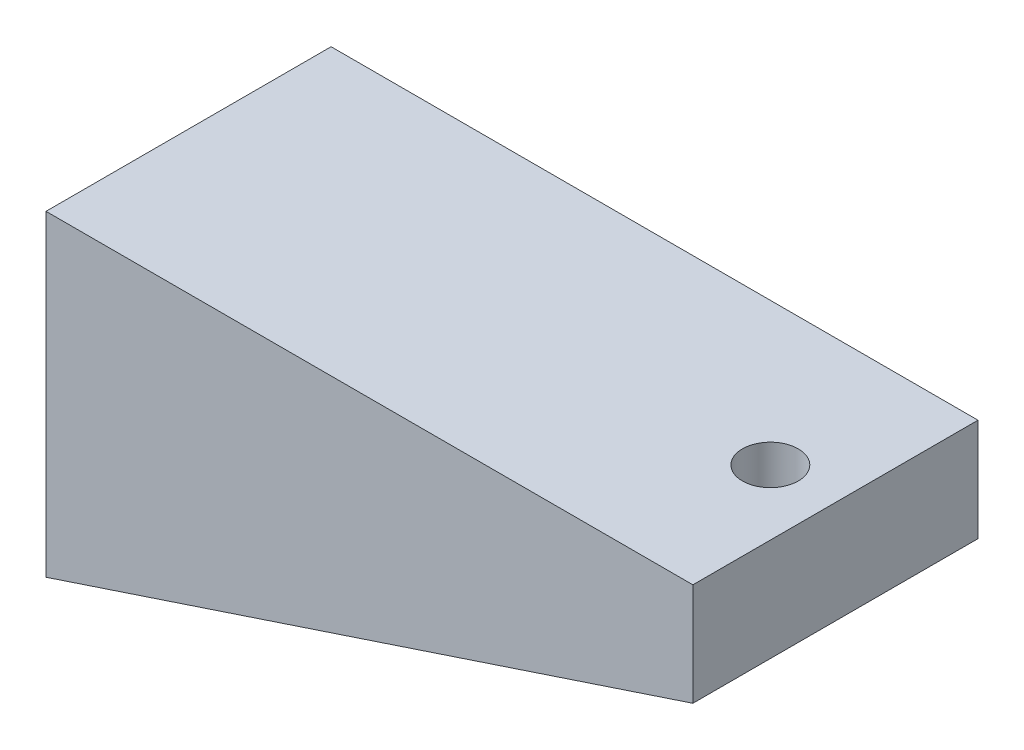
ISO-10303-21;
HEADER;
FILE_DESCRIPTION(('STEP AP214'),'2;1');
FILE_NAME('part.step','',(''),(''),'','','');
FILE_SCHEMA(('AUTOMOTIVE_DESIGN { 1 0 10303 214 1 1 1 1 }'));
ENDSEC;
DATA;
#1=APPLICATION_CONTEXT('core data for automotive mechanical design processes');
#2=APPLICATION_PROTOCOL_DEFINITION('international standard','automotive_design',2000,#1);
#3=PRODUCT_CONTEXT('',#1,'mechanical');
#4=PRODUCT('Part','Part','',(#3));
#5=PRODUCT_RELATED_PRODUCT_CATEGORY('part','',(#4));
#6=PRODUCT_DEFINITION_FORMATION('','',#4);
#7=PRODUCT_DEFINITION_CONTEXT('part definition',#1,'design');
#8=PRODUCT_DEFINITION('design','',#6,#7);
#9=PRODUCT_DEFINITION_SHAPE('','',#8);
#10=(LENGTH_UNIT() NAMED_UNIT(*) SI_UNIT(.MILLI.,.METRE.));
#11=(NAMED_UNIT(*) PLANE_ANGLE_UNIT() SI_UNIT($,.RADIAN.));
#12=(NAMED_UNIT(*) SI_UNIT($,.STERADIAN.) SOLID_ANGLE_UNIT());
#13=UNCERTAINTY_MEASURE_WITH_UNIT(LENGTH_MEASURE(1.E-05),#10,'distance_accuracy_value','');
#14=(GEOMETRIC_REPRESENTATION_CONTEXT(3) GLOBAL_UNCERTAINTY_ASSIGNED_CONTEXT((#13)) GLOBAL_UNIT_ASSIGNED_CONTEXT((#10,
#11,#12)) REPRESENTATION_CONTEXT('',''));
#15=CARTESIAN_POINT('',(0.,0.,0.));
#16=DIRECTION('',(0.,0.,1.));
#17=DIRECTION('',(1.,0.,0.));
#18=AXIS2_PLACEMENT_3D('',#15,#16,#17);
#19=CARTESIAN_POINT('',(0.,58.9096385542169,26.5));
#20=DIRECTION('',(1.,0.,0.));
#21=DIRECTION('',(0.,0.,-1.));
#22=AXIS2_PLACEMENT_3D('',#19,#20,#21);
#23=PLANE('',#22);
#24=DIRECTION('',(0.,-1.,0.));
#25=VECTOR('',#24,1.);
#26=CARTESIAN_POINT('',(0.,58.9096385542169,-26.5));
#27=LINE('',#26,#25);
#28=CARTESIAN_POINT('',(0.,58.9096385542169,-26.5));
#29=VERTEX_POINT('',#28);
#30=CARTESIAN_POINT('',(0.,0.,-26.5));
#31=VERTEX_POINT('',#30);
#32=EDGE_CURVE('E72',#29,#31,#27,.T.);
#33=ORIENTED_EDGE('',*,*,#32,.T.);
#34=DIRECTION('',(0.,0.,-1.));
#35=VECTOR('',#34,1.);
#36=CARTESIAN_POINT('',(0.,0.,26.5));
#37=LINE('',#36,#35);
#38=CARTESIAN_POINT('',(0.,0.,26.5));
#39=VERTEX_POINT('',#38);
#40=EDGE_CURVE('E12',#39,#31,#37,.T.);
#41=ORIENTED_EDGE('',*,*,#40,.F.);
#42=DIRECTION('',(0.,-1.,0.));
#43=VECTOR('',#42,1.);
#44=CARTESIAN_POINT('',(0.,58.9096385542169,26.5));
#45=LINE('',#44,#43);
#46=CARTESIAN_POINT('',(0.,58.9096385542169,26.5));
#47=VERTEX_POINT('',#46);
#48=EDGE_CURVE('E95',#47,#39,#45,.T.);
#49=ORIENTED_EDGE('',*,*,#48,.F.);
#50=DIRECTION('',(0.,0.,-1.));
#51=VECTOR('',#50,1.);
#52=CARTESIAN_POINT('',(0.,58.9096385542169,26.5));
#53=LINE('',#52,#51);
#54=EDGE_CURVE('E84',#47,#29,#53,.T.);
#55=ORIENTED_EDGE('',*,*,#54,.T.);
#56=EDGE_LOOP('',(#33,#41,#49,#55));
#57=FACE_BOUND('',#56,.T.);
#58=ADVANCED_FACE('F28',(#57),#23,.F.);
#59=CARTESIAN_POINT('',(0.,0.,26.5));
#60=DIRECTION('',(-0.314455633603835,0.949272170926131,0.));
#61=DIRECTION('',(-0.949272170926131,-0.314455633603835,0.));
#62=AXIS2_PLACEMENT_3D('',#59,#60,#61);
#63=PLANE('',#62);
#64=DIRECTION('',(0.949272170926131,0.314455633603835,0.));
#65=VECTOR('',#64,1.);
#66=CARTESIAN_POINT('',(0.,0.,-26.5));
#67=LINE('',#66,#65);
#68=CARTESIAN_POINT('',(120.25046854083,39.8341365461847,-26.5));
#69=VERTEX_POINT('',#68);
#70=EDGE_CURVE('E68',#31,#69,#67,.T.);
#71=ORIENTED_EDGE('',*,*,#70,.T.);
#72=DIRECTION('',(0.,0.,-1.));
#73=VECTOR('',#72,1.);
#74=CARTESIAN_POINT('',(120.25046854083,39.8341365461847,26.5));
#75=LINE('',#74,#73);
#76=CARTESIAN_POINT('',(120.25046854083,39.8341365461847,26.5));
#77=VERTEX_POINT('',#76);
#78=EDGE_CURVE('E35',#77,#69,#75,.T.);
#79=ORIENTED_EDGE('',*,*,#78,.F.);
#80=DIRECTION('',(0.949272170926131,0.314455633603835,0.));
#81=VECTOR('',#80,1.);
#82=CARTESIAN_POINT('',(0.,0.,26.5));
#83=LINE('',#82,#81);
#84=EDGE_CURVE('E80',#39,#77,#83,.T.);
#85=ORIENTED_EDGE('',*,*,#84,.F.);
#86=ORIENTED_EDGE('',*,*,#40,.T.);
#87=EDGE_LOOP('',(#71,#79,#85,#86));
#88=FACE_BOUND('',#87,.T.);
#89=ADVANCED_FACE('F79',(#88),#63,.F.);
#90=CARTESIAN_POINT('',(120.25046854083,39.8341365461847,26.5));
#91=DIRECTION('',(-1.,0.,0.));
#92=DIRECTION('',(0.,0.,1.));
#93=AXIS2_PLACEMENT_3D('',#90,#91,#92);
#94=PLANE('',#93);
#95=DIRECTION('',(0.,1.,0.));
#96=VECTOR('',#95,1.);
#97=CARTESIAN_POINT('',(120.25046854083,39.8341365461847,-26.5));
#98=LINE('',#97,#96);
#99=CARTESIAN_POINT('',(120.25046854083,58.9096385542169,-26.5));
#100=VERTEX_POINT('',#99);
#101=EDGE_CURVE('E73',#69,#100,#98,.T.);
#102=ORIENTED_EDGE('',*,*,#101,.T.);
#103=DIRECTION('',(0.,0.,-1.));
#104=VECTOR('',#103,1.);
#105=CARTESIAN_POINT('',(120.25046854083,58.9096385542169,26.5));
#106=LINE('',#105,#104);
#107=CARTESIAN_POINT('',(120.25046854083,58.9096385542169,26.5));
#108=VERTEX_POINT('',#107);
#109=EDGE_CURVE('E101',#108,#100,#106,.T.);
#110=ORIENTED_EDGE('',*,*,#109,.F.);
#111=DIRECTION('',(0.,1.,0.));
#112=VECTOR('',#111,1.);
#113=CARTESIAN_POINT('',(120.25046854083,39.8341365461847,26.5));
#114=LINE('',#113,#112);
#115=EDGE_CURVE('E47',#77,#108,#114,.T.);
#116=ORIENTED_EDGE('',*,*,#115,.F.);
#117=ORIENTED_EDGE('',*,*,#78,.T.);
#118=EDGE_LOOP('',(#102,#110,#116,#117));
#119=FACE_BOUND('',#118,.T.);
#120=ADVANCED_FACE('F104',(#119),#94,.F.);
#121=CARTESIAN_POINT('',(120.25046854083,58.9096385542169,26.5));
#122=DIRECTION('',(0.,-1.,0.));
#123=DIRECTION('',(1.,0.,0.));
#124=AXIS2_PLACEMENT_3D('',#121,#122,#123);
#125=PLANE('',#124);
#126=CARTESIAN_POINT('',(108.150298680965,58.9096385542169,0.));
#127=DIRECTION('',(0.,1.,0.));
#128=DIRECTION('',(-1.,0.,0.));
#129=AXIS2_PLACEMENT_3D('',#126,#127,#128);
#130=CIRCLE('',#129,5.18706468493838);
#131=CARTESIAN_POINT('',(102.963233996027,58.9096385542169,0.));
#132=VERTEX_POINT('',#131);
#133=EDGE_CURVE('E88',#132,#132,#130,.T.);
#134=ORIENTED_EDGE('',*,*,#133,.F.);
#135=EDGE_LOOP('',(#134));
#136=FACE_BOUND('',#135,.T.);
#137=DIRECTION('',(-1.,0.,0.));
#138=VECTOR('',#137,1.);
#139=CARTESIAN_POINT('',(120.25046854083,58.9096385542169,-26.5));
#140=LINE('',#139,#138);
#141=EDGE_CURVE('E93',#100,#29,#140,.T.);
#142=ORIENTED_EDGE('',*,*,#141,.T.);
#143=ORIENTED_EDGE('',*,*,#54,.F.);
#144=DIRECTION('',(-1.,0.,0.));
#145=VECTOR('',#144,1.);
#146=CARTESIAN_POINT('',(120.25046854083,58.9096385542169,26.5));
#147=LINE('',#146,#145);
#148=EDGE_CURVE('E42',#108,#47,#147,.T.);
#149=ORIENTED_EDGE('',*,*,#148,.F.);
#150=ORIENTED_EDGE('',*,*,#109,.T.);
#151=EDGE_LOOP('',(#142,#143,#149,#150));
#152=FACE_BOUND('',#151,.T.);
#153=ADVANCED_FACE('F106',(#136,#152),#125,.F.);
#154=CARTESIAN_POINT('',(0.,58.9096385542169,26.5));
#155=DIRECTION('',(0.,0.,-1.));
#156=DIRECTION('',(-1.,0.,0.));
#157=AXIS2_PLACEMENT_3D('',#154,#155,#156);
#158=PLANE('',#157);
#159=ORIENTED_EDGE('',*,*,#48,.T.);
#160=ORIENTED_EDGE('',*,*,#84,.T.);
#161=ORIENTED_EDGE('',*,*,#115,.T.);
#162=ORIENTED_EDGE('',*,*,#148,.T.);
#163=EDGE_LOOP('',(#159,#160,#161,#162));
#164=FACE_BOUND('',#163,.T.);
#165=ADVANCED_FACE('F107',(#164),#158,.F.);
#166=CARTESIAN_POINT('',(0.,58.9096385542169,-26.5));
#167=DIRECTION('',(0.,0.,-1.));
#168=DIRECTION('',(-1.,0.,0.));
#169=AXIS2_PLACEMENT_3D('',#166,#167,#168);
#170=PLANE('',#169);
#171=ORIENTED_EDGE('',*,*,#32,.F.);
#172=ORIENTED_EDGE('',*,*,#141,.F.);
#173=ORIENTED_EDGE('',*,*,#101,.F.);
#174=ORIENTED_EDGE('',*,*,#70,.F.);
#175=EDGE_LOOP('',(#171,#172,#173,#174));
#176=FACE_BOUND('',#175,.T.);
#177=ADVANCED_FACE('F69',(#176),#170,.T.);
#178=CARTESIAN_POINT('',(108.150298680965,21.0297909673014,0.));
#179=DIRECTION('',(0.,1.,0.));
#180=DIRECTION('',(-1.,0.,0.));
#181=AXIS2_PLACEMENT_3D('',#178,#179,#180);
#182=CYLINDRICAL_SURFACE('',#181,5.18706468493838);
#183=CARTESIAN_POINT('',(108.150298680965,41.0930309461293,0.));
#184=DIRECTION('',(-0.314455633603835,0.949272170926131,0.));
#185=DIRECTION('',(0.949272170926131,0.314455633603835,0.));
#186=AXIS2_PLACEMENT_3D('',#183,#184,#185);
#187=ELLIPSE('',#186,5.4642544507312,5.18706468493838);
#188=CARTESIAN_POINT('',(113.337363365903,42.8112965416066,0.));
#189=VERTEX_POINT('',#188);
#190=EDGE_CURVE('E85',#189,#189,#187,.F.);
#191=ORIENTED_EDGE('',*,*,#190,.T.);
#192=EDGE_LOOP('',(#191));
#193=FACE_BOUND('',#192,.T.);
#194=ORIENTED_EDGE('',*,*,#133,.T.);
#195=EDGE_LOOP('',(#194));
#196=FACE_BOUND('',#195,.T.);
#197=ADVANCED_FACE('F114',(#193,#196),#182,.F.);
#198=CARTESIAN_POINT('',(-1.57227816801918,4.74636085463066,26.5));
#199=DIRECTION('',(-0.314455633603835,0.949272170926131,0.));
#200=DIRECTION('',(-0.949272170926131,-0.314455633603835,0.));
#201=AXIS2_PLACEMENT_3D('',#198,#199,#200);
#202=PLANE('',#201);
#203=ORIENTED_EDGE('',*,*,#190,.F.);
#204=EDGE_LOOP('',(#203));
#205=FACE_BOUND('',#204,.T.);
#206=ADVANCED_FACE('F147',(#205),#202,.T.);
#207=CLOSED_SHELL('',(#58,#89,#120,#153,#165,#177,#197,#206));
#208=MANIFOLD_SOLID_BREP('B2',#207);
#209=ADVANCED_BREP_SHAPE_REPRESENTATION('',(#18,#208),#14);
#210=SHAPE_DEFINITION_REPRESENTATION(#9,#209);
ENDSEC;
END-ISO-10303-21;
